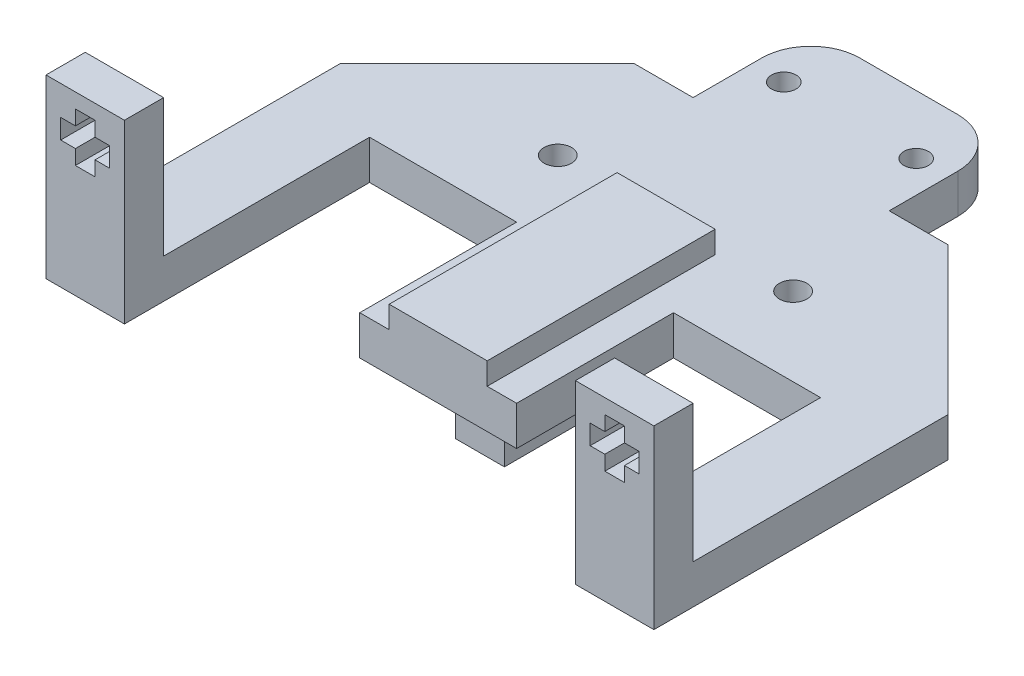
from build123d import *

# Parameters (mm, degrees)
BOSS_EXTRUDE1_DEPTH      = 4
SKETCH3_W                = 4
SKETCH3_H                = 14
BOSS_EXTRUDE6_DEPTH      = 8
CUT_EXTRUDE1_REACH       = 65.797
SKETCH5_W                = 20
SKETCH5_H                = 15
SKETCH5_R                = 1.25
BOSS_EXTRUDE7_DEPTH      = 4
FILLET1_R                = 5
CHAMFER1_SIZE            = 15
SKETCH6_W                = 4
SKETCH6_H                = 16
CUT_EXTRUDE2_DEPTH       = 10
SKETCH7_W                = 4
SKETCH7_H                = 16
CUT_EXTRUDE3_DEPTH       = 10
SKETCH8_W                = 10
SKETCH8_H                = 23.24839154
BOSS_EXTRUDE8_DEPTH      = 2.25
SKETCH9_R                = 1.4
CUT_EXTRUDE4_DEPTH       = 3
BOSS_EXTRUDE9_DEPTH      = 9
BOSS_EXTRUDE9_DEPTH_BACK = 4
SKETCH10_W               = 5
SKETCH10_H               = 3.244962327
SKETCH11_W               = 5
SKETCH11_H               = 8
BOSS_EXTRUDE10_DEPTH     = 4
SKETCH14_W               = 3
SKETCH14_H               = 5
BOSS_EXTRUDE13_DEPTH     = 9
SKETCH15_W               = 8
SKETCH15_H               = 5
BOSS_EXTRUDE14_DEPTH     = 4


with BuildPart() as part:
    # Sketch1 → Boss-Extrude1 (new body)
    with BuildSketch(Plane(origin=(0, 0, 0), x_dir=(1, 0, 0), z_dir=(0, 1, 0))):
        Polygon((-24, 0), (0, 0), (0, 16), (11, 16), (11, -9), (19, -9), (19, 36), (-43, 36), (-43, -9), (-35, -9), (-35, 16), (-24, 16), align=None)
    extrude(amount=-BOSS_EXTRUDE1_DEPTH)

    # Sketch3 → Boss-Extrude6 (add)
    with BuildSketch(Plane(origin=(19, 0, 0), x_dir=(0, 0, -1), z_dir=(1, 0, 0))):
        with Locations((-7, 7)):
            Rectangle(SKETCH3_W, SKETCH3_H)
    boss_extrude6 = extrude(amount=-BOSS_EXTRUDE6_DEPTH)

    # Mirror1: Boss-Extrude6 across plane
    add(boss_extrude6.mirror(Plane(origin=(-12, 0, 0), x_dir=(0, 0, 1), z_dir=(1, 0, 0))))

    # Sketch4 → Cut-Extrude1 (cut, up to next)
    with BuildSketch(Plane.XY.offset(9), mode=Mode.PRIVATE) as cut_extrude1_sk1:
        Polygon((-41.5, 9), (-41.5, 10), (-41.5, 11), (-40, 11), (-40, 12.5), (-39, 12.5), (-38, 12.5), (-38, 11), (-36.5, 11), (-36.5, 10), (-36.5, 9), (-38, 9), (-38, 7.5), (-39, 7.5), (-40, 7.5), (-40, 9), align=None)
    cut_extrude1_tool1 = extrude(cut_extrude1_sk1.sketch, amount=-CUT_EXTRUDE1_REACH, mode=Mode.PRIVATE) & part.part
    # Sketch4 → Cut-Extrude1 (cut, up to next)
    with BuildSketch(Plane.XY.offset(9), mode=Mode.PRIVATE) as cut_extrude1_sk2:
        Polygon((16, 11), (16, 12.5), (15, 12.5), (14, 12.5), (14, 11), (12.5, 11), (12.5, 10), (12.5, 9), (14, 9), (14, 7.5), (15, 7.5), (16, 7.5), (16, 9), (17.5, 9), (17.5, 10), (17.5, 11), align=None)
    cut_extrude1_tool2 = extrude(cut_extrude1_sk2.sketch, amount=-CUT_EXTRUDE1_REACH, mode=Mode.PRIVATE) & part.part
    add(cut_extrude1_tool1.solids().sort_by_distance((-39, 10, 9))[0], mode=Mode.SUBTRACT)
    add(cut_extrude1_tool2.solids().sort_by_distance((15, 10, 9))[0], mode=Mode.SUBTRACT)

    # Sketch5 → Boss-Extrude7 (add)
    with BuildSketch(Plane(origin=(0, 0, 0), x_dir=(1, 0, 0), z_dir=(0, 1, 0))):
        with Locations((-12, 40.5)):
            Rectangle(SKETCH5_W, SKETCH5_H)
        with Locations(Location((-18.75, 42, 0), (0, 0, 270))):
            Circle(SKETCH5_R, mode=Mode.SUBTRACT)
        with Locations(Location((-5.25, 42, 0), (0, 0, 90))):
            Circle(SKETCH5_R, mode=Mode.SUBTRACT)
    extrude(amount=-BOSS_EXTRUDE7_DEPTH)

    # Fillet1
    fillet1_edges = [part.edges().sort_by_distance(p)[0] for p in [
        (-2, -2, -48),
        (-22, -2, -48),
    ]]
    fillet(fillet1_edges, radius=FILLET1_R)

    # Chamfer1
    chamfer1_edges = [part.edges().sort_by_distance(p)[0] for p in [
        (19, -2, -36),
        (-43, -2, -36),
    ]]
    chamfer(chamfer1_edges, length=CHAMFER1_SIZE)

    # Sketch6 → Cut-Extrude2 (cut)
    with BuildSketch(Plane(origin=(0, 0, 0), x_dir=(1, 0, 0), z_dir=(0, 1, 0))):
        with Locations((-22, 8)):
            Rectangle(SKETCH6_W, SKETCH6_H)
    extrude(amount=-CUT_EXTRUDE2_DEPTH, mode=Mode.SUBTRACT)

    # Sketch7 → Cut-Extrude3 (cut)
    with BuildSketch(Plane(origin=(0, 0, 0), x_dir=(1, 0, 0), z_dir=(0, 1, 0))):
        with Locations((-2, 8)):
            Rectangle(SKETCH7_W, SKETCH7_H)
    extrude(amount=-CUT_EXTRUDE3_DEPTH, mode=Mode.SUBTRACT)

    # Sketch8 → Boss-Extrude8 (add)
    with BuildSketch(Plane(origin=(0, 0, 0), x_dir=(1, 0, 0), z_dir=(0, 1, 0))):
        with Locations((-12, 11.62419577)):
            Rectangle(SKETCH8_W, SKETCH8_H)
    extrude(amount=BOSS_EXTRUDE8_DEPTH)

    # Sketch9 → Cut-Extrude4 (cut)
    with BuildSketch(Plane(origin=(0, 0, 0), x_dir=(1, 0, 0), z_dir=(0, 1, 0))):
        with Locations(Location((-23.8, 24, 0), (0, 0, 270))):
            Circle(SKETCH9_R)
        with Locations(Location((0.2, 24, 0), (0, 0, 270))):
            Circle(SKETCH9_R)
    extrude(amount=-CUT_EXTRUDE4_DEPTH, mode=Mode.SUBTRACT)

    # Sketch10 → Boss-Extrude9 (add, two sides: drawn at the far end of the back side and taken through both)
    with BuildSketch(Plane(origin=(0, -4, 6), x_dir=(-1, 0, 0), z_dir=(0, -1, 0)).offset(-BOSS_EXTRUDE9_DEPTH_BACK)):
        with Locations((14.5, 14.377518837)):
            Rectangle(SKETCH10_W, SKETCH10_H)
    extrude(amount=BOSS_EXTRUDE9_DEPTH + BOSS_EXTRUDE9_DEPTH_BACK)

    # Sketch11 → Boss-Extrude10 (add)
    with BuildSketch(Plane(origin=(0, -13, 6), x_dir=(-1, 0, 0), z_dir=(0, -1, 0))):
        with Locations((14.5, 18.0818584)):
            Rectangle(SKETCH11_W, SKETCH11_H)
    extrude(amount=-BOSS_EXTRUDE10_DEPTH)

    # Sketch14 → Boss-Extrude13 (add)
    with BuildSketch(Plane(origin=(0, -4, 0), x_dir=(-1, 0, 0), z_dir=(0, -1, 0))):
        with Locations((-1.533544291, 27.537901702)):
            Rectangle(SKETCH14_W, SKETCH14_H)
    extrude(amount=BOSS_EXTRUDE13_DEPTH)

    # Sketch15 → Boss-Extrude14 (add)
    with BuildSketch(Plane(origin=(0, -13, 0), x_dir=(-1, 0, 0), z_dir=(0, -1, 0))):
        with Locations((0.966455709, 27.537901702)):
            Rectangle(SKETCH15_W, SKETCH15_H)
    extrude(amount=-BOSS_EXTRUDE14_DEPTH)


solid = part.part
